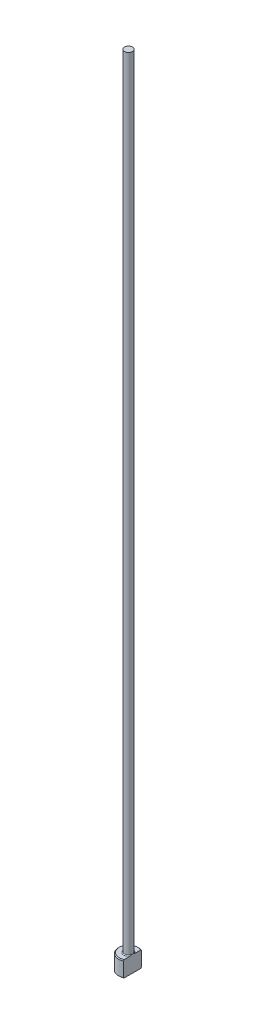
ISO-10303-21;
HEADER;
FILE_DESCRIPTION(('STEP AP214'),'2;1');
FILE_NAME('part.step','',(''),(''),'','','');
FILE_SCHEMA(('AUTOMOTIVE_DESIGN { 1 0 10303 214 1 1 1 1 }'));
ENDSEC;
DATA;
#1=APPLICATION_CONTEXT('core data for automotive mechanical design processes');
#2=APPLICATION_PROTOCOL_DEFINITION('international standard','automotive_design',2000,#1);
#3=PRODUCT_CONTEXT('',#1,'mechanical');
#4=PRODUCT('Part','Part','',(#3));
#5=PRODUCT_RELATED_PRODUCT_CATEGORY('part','',(#4));
#6=PRODUCT_DEFINITION_FORMATION('','',#4);
#7=PRODUCT_DEFINITION_CONTEXT('part definition',#1,'design');
#8=PRODUCT_DEFINITION('design','',#6,#7);
#9=PRODUCT_DEFINITION_SHAPE('','',#8);
#10=(LENGTH_UNIT() NAMED_UNIT(*) SI_UNIT(.MILLI.,.METRE.));
#11=(NAMED_UNIT(*) PLANE_ANGLE_UNIT() SI_UNIT($,.RADIAN.));
#12=(NAMED_UNIT(*) SI_UNIT($,.STERADIAN.) SOLID_ANGLE_UNIT());
#13=UNCERTAINTY_MEASURE_WITH_UNIT(LENGTH_MEASURE(1.E-05),#10,'distance_accuracy_value','');
#14=(GEOMETRIC_REPRESENTATION_CONTEXT(3) GLOBAL_UNCERTAINTY_ASSIGNED_CONTEXT((#13)) GLOBAL_UNIT_ASSIGNED_CONTEXT((#10,
#11,#12)) REPRESENTATION_CONTEXT('',''));
#15=CARTESIAN_POINT('',(0.,0.,0.));
#16=DIRECTION('',(0.,0.,1.));
#17=DIRECTION('',(1.,0.,0.));
#18=AXIS2_PLACEMENT_3D('',#15,#16,#17);
#19=CARTESIAN_POINT('',(0.,0.,0.));
#20=DIRECTION('',(0.,-1.,0.));
#21=DIRECTION('',(0.,0.,-1.));
#22=AXIS2_PLACEMENT_3D('',#19,#20,#21);
#23=PLANE('',#22);
#24=CARTESIAN_POINT('',(0.,0.,0.));
#25=DIRECTION('',(0.,-1.,0.));
#26=DIRECTION('',(0.,0.,-1.));
#27=AXIS2_PLACEMENT_3D('',#24,#25,#26);
#28=CIRCLE('',#27,2.29999999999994);
#29=CARTESIAN_POINT('',(0.999999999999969,0.,2.07123151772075));
#30=VERTEX_POINT('',#29);
#31=CARTESIAN_POINT('',(0.999999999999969,0.,-2.07123151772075));
#32=VERTEX_POINT('',#31);
#33=EDGE_CURVE('E98',#30,#32,#28,.T.);
#34=ORIENTED_EDGE('',*,*,#33,.T.);
#35=DIRECTION('',(0.,0.,1.));
#36=VECTOR('',#35,1.);
#37=CARTESIAN_POINT('',(0.999999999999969,0.,2.2912878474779));
#38=LINE('',#37,#36);
#39=EDGE_CURVE('E83',#32,#30,#38,.T.);
#40=ORIENTED_EDGE('',*,*,#39,.T.);
#41=EDGE_LOOP('',(#34,#40));
#42=FACE_BOUND('',#41,.T.);
#43=ADVANCED_FACE('F32',(#42),#23,.T.);
#44=CARTESIAN_POINT('',(0.,259.958771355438,0.));
#45=DIRECTION('',(0.,1.,0.));
#46=DIRECTION('',(0.,0.,1.));
#47=AXIS2_PLACEMENT_3D('',#44,#45,#46);
#48=CYLINDRICAL_SURFACE('',#47,2.49999999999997);
#49=CARTESIAN_POINT('',(0.,3.80000000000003,0.));
#50=DIRECTION('',(0.,1.,0.));
#51=DIRECTION('',(0.,0.,1.));
#52=AXIS2_PLACEMENT_3D('',#49,#50,#51);
#53=CIRCLE('',#52,2.49999999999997);
#54=CARTESIAN_POINT('',(0.999999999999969,3.80000000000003,2.2912878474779));
#55=VERTEX_POINT('',#54);
#56=CARTESIAN_POINT('',(0.999999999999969,3.80000000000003,-2.2912878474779));
#57=VERTEX_POINT('',#56);
#58=EDGE_CURVE('E104',#55,#57,#53,.F.);
#59=ORIENTED_EDGE('',*,*,#58,.T.);
#60=DIRECTION('',(0.,-1.,0.));
#61=VECTOR('',#60,1.);
#62=CARTESIAN_POINT('',(0.999999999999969,200.,-2.2912878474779));
#63=LINE('',#62,#61);
#64=CARTESIAN_POINT('',(0.999999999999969,0.199999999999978,-2.2912878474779));
#65=VERTEX_POINT('',#64);
#66=EDGE_CURVE('E183',#57,#65,#63,.T.);
#67=ORIENTED_EDGE('',*,*,#66,.T.);
#68=CARTESIAN_POINT('',(0.,0.199999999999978,0.));
#69=DIRECTION('',(0.,-1.,0.));
#70=DIRECTION('',(0.,0.,-1.));
#71=AXIS2_PLACEMENT_3D('',#68,#69,#70);
#72=CIRCLE('',#71,2.49999999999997);
#73=CARTESIAN_POINT('',(0.999999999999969,0.199999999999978,2.2912878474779));
#74=VERTEX_POINT('',#73);
#75=EDGE_CURVE('E100',#65,#74,#72,.F.);
#76=ORIENTED_EDGE('',*,*,#75,.T.);
#77=DIRECTION('',(0.,-1.,0.));
#78=VECTOR('',#77,1.);
#79=CARTESIAN_POINT('',(0.999999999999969,200.,2.2912878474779));
#80=LINE('',#79,#78);
#81=EDGE_CURVE('E93',#55,#74,#80,.T.);
#82=ORIENTED_EDGE('',*,*,#81,.F.);
#83=EDGE_LOOP('',(#59,#67,#76,#82));
#84=FACE_BOUND('',#83,.T.);
#85=ADVANCED_FACE('F158',(#84),#48,.T.);
#86=CARTESIAN_POINT('',(-2.49999999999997,4.,0.));
#87=DIRECTION('',(0.,1.,0.));
#88=DIRECTION('',(0.,0.,1.));
#89=AXIS2_PLACEMENT_3D('',#86,#87,#88);
#90=PLANE('',#89);
#91=CARTESIAN_POINT('',(0.,4.,0.));
#92=DIRECTION('',(0.,1.,0.));
#93=DIRECTION('',(0.,0.,1.));
#94=AXIS2_PLACEMENT_3D('',#91,#92,#93);
#95=CIRCLE('',#94,2.3);
#96=CARTESIAN_POINT('',(0.999999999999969,4.,-2.07123151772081));
#97=VERTEX_POINT('',#96);
#98=CARTESIAN_POINT('',(0.999999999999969,4.,2.07123151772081));
#99=VERTEX_POINT('',#98);
#100=EDGE_CURVE('E178',#97,#99,#95,.T.);
#101=ORIENTED_EDGE('',*,*,#100,.T.);
#102=DIRECTION('',(0.,0.,-1.));
#103=VECTOR('',#102,1.);
#104=CARTESIAN_POINT('',(0.999999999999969,4.,0.));
#105=LINE('',#104,#103);
#106=CARTESIAN_POINT('',(0.999999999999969,3.99999999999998,0.663324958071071));
#107=VERTEX_POINT('',#106);
#108=EDGE_CURVE('E57',#99,#107,#105,.T.);
#109=ORIENTED_EDGE('',*,*,#108,.T.);
#110=CARTESIAN_POINT('',(0.,4.,0.));
#111=DIRECTION('',(0.,1.,0.));
#112=DIRECTION('',(0.,0.,1.));
#113=AXIS2_PLACEMENT_3D('',#110,#111,#112);
#114=CIRCLE('',#113,1.19999999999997);
#115=CARTESIAN_POINT('',(0.999999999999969,3.99999999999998,-0.663324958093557));
#116=VERTEX_POINT('',#115);
#117=EDGE_CURVE('E107',#107,#116,#114,.F.);
#118=ORIENTED_EDGE('',*,*,#117,.T.);
#119=EDGE_CURVE('E136',#116,#97,#105,.T.);
#120=ORIENTED_EDGE('',*,*,#119,.T.);
#121=EDGE_LOOP('',(#101,#109,#118,#120));
#122=FACE_BOUND('',#121,.T.);
#123=ADVANCED_FACE('F147',(#122),#90,.T.);
#124=CARTESIAN_POINT('',(0.,4.,0.));
#125=DIRECTION('',(0.,-1.,0.));
#126=DIRECTION('',(0.,0.,-1.));
#127=AXIS2_PLACEMENT_3D('',#124,#125,#126);
#128=CONICAL_SURFACE('',#127,2.3,0.785398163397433);
#129=ORIENTED_EDGE('',*,*,#58,.F.);
#130=CARTESIAN_POINT('',(0.999999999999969,1.15817039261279,5.043650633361));
#131=CARTESIAN_POINT('',(0.999999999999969,1.28171614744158,4.91769392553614));
#132=CARTESIAN_POINT('',(0.999999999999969,1.40517853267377,4.7916552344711));
#133=CARTESIAN_POINT('',(0.999999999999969,1.65205736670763,4.53917252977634));
#134=CARTESIAN_POINT('',(0.999999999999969,1.7754734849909,4.41272819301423));
#135=CARTESIAN_POINT('',(0.999999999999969,2.02507999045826,4.15641759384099));
#136=CARTESIAN_POINT('',(0.999999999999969,2.15126317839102,4.02654431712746));
#137=CARTESIAN_POINT('',(0.999999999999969,2.40304621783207,3.76660249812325));
#138=CARTESIAN_POINT('',(0.999999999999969,2.52864665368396,3.63653452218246));
#139=CARTESIAN_POINT('',(0.999999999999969,2.7677697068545,3.38787610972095));
#140=CARTESIAN_POINT('',(0.999999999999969,2.88133977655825,3.26933134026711));
#141=CARTESIAN_POINT('',(0.999999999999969,3.10787167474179,3.03166264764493));
#142=CARTESIAN_POINT('',(0.999999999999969,3.22083350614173,2.91253872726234));
#143=CARTESIAN_POINT('',(0.999999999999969,3.4465699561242,2.67277252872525));
#144=CARTESIAN_POINT('',(0.999999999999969,3.55933947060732,2.5521254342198));
#145=CARTESIAN_POINT('',(0.999999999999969,3.7835162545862,2.30972256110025));
#146=CARTESIAN_POINT('',(0.999999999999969,3.8949243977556,2.18796759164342));
#147=CARTESIAN_POINT('',(0.999999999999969,4.11318730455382,1.94548589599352));
#148=CARTESIAN_POINT('',(0.999999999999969,4.22008776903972,1.82480064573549));
#149=CARTESIAN_POINT('',(0.999999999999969,4.37813361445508,1.64149718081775));
#150=CARTESIAN_POINT('',(0.999999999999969,4.43049954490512,1.57993333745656));
#151=CARTESIAN_POINT('',(0.999999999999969,4.53410631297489,1.45586813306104));
#152=CARTESIAN_POINT('',(0.999999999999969,4.58534721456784,1.39336682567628));
#153=CARTESIAN_POINT('',(0.999999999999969,4.68568582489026,1.26783988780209));
#154=CARTESIAN_POINT('',(0.999999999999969,4.734801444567,1.20482863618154));
#155=CARTESIAN_POINT('',(0.999999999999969,4.83086890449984,1.07709082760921));
#156=CARTESIAN_POINT('',(0.999999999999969,4.87781921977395,1.01236311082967));
#157=CARTESIAN_POINT('',(0.999999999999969,4.968185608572,0.88091166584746));
#158=CARTESIAN_POINT('',(0.999999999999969,5.01161706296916,0.814198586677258));
#159=CARTESIAN_POINT('',(0.999999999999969,5.09325231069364,0.677671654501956));
#160=CARTESIAN_POINT('',(0.999999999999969,5.13146487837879,0.60786327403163));
#161=CARTESIAN_POINT('',(0.999999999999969,5.1726089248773,0.520757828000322));
#162=CARTESIAN_POINT('',(0.999999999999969,5.17963219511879,0.505387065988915));
#163=CARTESIAN_POINT('',(0.999999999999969,5.19324475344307,0.47444817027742));
#164=CARTESIAN_POINT('',(0.999999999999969,5.19983388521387,0.458879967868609));
#165=CARTESIAN_POINT('',(0.999999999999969,5.21887613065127,0.411884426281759));
#166=CARTESIAN_POINT('',(0.999999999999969,5.2306077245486,0.380158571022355));
#167=CARTESIAN_POINT('',(0.999999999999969,5.25156131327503,0.3164103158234));
#168=CARTESIAN_POINT('',(0.999999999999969,5.26081845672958,0.284399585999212));
#169=CARTESIAN_POINT('',(0.999999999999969,5.27663134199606,0.219696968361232));
#170=CARTESIAN_POINT('',(0.999999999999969,5.28318629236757,0.18700488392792));
#171=CARTESIAN_POINT('',(0.999999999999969,5.2933221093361,0.120434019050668));
#172=CARTESIAN_POINT('',(0.999999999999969,5.29683603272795,0.0865448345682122));
#173=CARTESIAN_POINT('',(0.999999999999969,5.30040235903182,0.0185934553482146));
#174=CARTESIAN_POINT('',(0.999999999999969,5.30045600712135,-0.0154686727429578));
#175=CARTESIAN_POINT('',(0.999999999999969,5.29709918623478,-0.0834515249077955));
#176=CARTESIAN_POINT('',(0.999999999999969,5.29368537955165,-0.117372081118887));
#177=CARTESIAN_POINT('',(0.999999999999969,5.28362616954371,-0.184734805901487));
#178=CARTESIAN_POINT('',(0.999999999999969,5.27697933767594,-0.218176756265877));
#179=CARTESIAN_POINT('',(0.999999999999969,5.25861838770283,-0.293522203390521));
#180=CARTESIAN_POINT('',(0.999999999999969,5.24601100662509,-0.335206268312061));
#181=CARTESIAN_POINT('',(0.999999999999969,5.21711806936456,-0.417267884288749));
#182=CARTESIAN_POINT('',(0.999999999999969,5.20083078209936,-0.457644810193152));
#183=CARTESIAN_POINT('',(0.999999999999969,5.16531625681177,-0.537392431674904));
#184=CARTESIAN_POINT('',(0.999999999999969,5.1460699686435,-0.576754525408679));
#185=CARTESIAN_POINT('',(0.999999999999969,5.10541239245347,-0.654316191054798));
#186=CARTESIAN_POINT('',(0.999999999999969,5.08400173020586,-0.692516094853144));
#187=CARTESIAN_POINT('',(0.999999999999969,5.0381127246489,-0.770330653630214));
#188=CARTESIAN_POINT('',(0.999999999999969,5.01352589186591,-0.809880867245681));
#189=CARTESIAN_POINT('',(0.999999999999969,4.96292539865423,-0.88806136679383));
#190=CARTESIAN_POINT('',(0.999999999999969,4.93691146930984,-0.926691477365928));
#191=CARTESIAN_POINT('',(0.999999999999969,4.85720012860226,-1.04150369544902));
#192=CARTESIAN_POINT('',(0.999999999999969,4.80186935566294,-1.11654866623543));
#193=CARTESIAN_POINT('',(0.999999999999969,4.68838315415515,-1.26473866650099));
#194=CARTESIAN_POINT('',(0.999999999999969,4.63022092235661,-1.33787839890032));
#195=CARTESIAN_POINT('',(0.999999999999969,4.51208910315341,-1.48269245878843));
#196=CARTESIAN_POINT('',(0.999999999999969,4.45211930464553,-1.55436661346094));
#197=CARTESIAN_POINT('',(0.999999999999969,4.33067987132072,-1.69694421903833));
#198=CARTESIAN_POINT('',(0.999999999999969,4.26920502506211,-1.76784320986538));
#199=CARTESIAN_POINT('',(0.999999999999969,4.14533845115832,-1.90884637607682));
#200=CARTESIAN_POINT('',(0.999999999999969,4.08294663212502,-1.97895047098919));
#201=CARTESIAN_POINT('',(0.999999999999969,3.89498664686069,-2.18811918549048));
#202=CARTESIAN_POINT('',(0.999999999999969,3.76842113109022,-2.32628638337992));
#203=CARTESIAN_POINT('',(0.999999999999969,3.5387546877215,-2.57413295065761));
#204=CARTESIAN_POINT('',(0.999999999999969,3.43593273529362,-2.68407249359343));
#205=CARTESIAN_POINT('',(0.999999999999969,3.22955977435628,-2.9032684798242));
#206=CARTESIAN_POINT('',(0.999999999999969,3.12600875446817,-3.01252491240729));
#207=CARTESIAN_POINT('',(0.999999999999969,2.81444279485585,-3.33969806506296));
#208=CARTESIAN_POINT('',(0.999999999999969,2.60565048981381,-3.55687358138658));
#209=CARTESIAN_POINT('',(0.999999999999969,2.19072410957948,-3.98610808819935));
#210=CARTESIAN_POINT('',(0.999999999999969,1.98461149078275,-4.19818787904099));
#211=CARTESIAN_POINT('',(0.999999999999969,1.674966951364,-4.51569174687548));
#212=CARTESIAN_POINT('',(0.999999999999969,1.57171087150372,-4.62138500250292));
#213=CARTESIAN_POINT('',(0.999999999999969,1.36504682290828,-4.83262218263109));
#214=CARTESIAN_POINT('',(0.999999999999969,1.26163885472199,-4.93816610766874));
#215=CARTESIAN_POINT('',(0.999999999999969,1.15817039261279,-5.043650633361));
#216=B_SPLINE_CURVE_WITH_KNOTS('',3,(#130,#131,#132,#133,#134,#135,#136,#137,#138,#139,#140,
#141,#142,#143,#144,#145,#146,#147,#148,#149,#150,#151,#152,#153,#154,#155,#156,#157,#158,#159,
#160,#161,#162,#163,#164,#165,#166,#167,#168,#169,#170,#171,#172,#173,#174,#175,#176,#177,#178,
#179,#180,#181,#182,#183,#184,#185,#186,#187,#188,#189,#190,#191,#192,#193,#194,#195,#196,#197,
#198,#199,#200,#201,#202,#203,#204,#205,#206,#207,#208,#209,#210,#211,#212,#213,#214,#215),
.UNSPECIFIED.,.F.,.F.,(4,2,2,2,2,2,2,2,2,2,2,2,2,2,2,2,2,2,2,2,2,2,2,2,2,2,2,2,2,2,2,2,2,2,2,2,
2,2,2,2,2,2,4),(0.,0.529299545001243,1.0593722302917,1.6026057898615,2.14504205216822,
2.6375434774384,3.13004253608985,3.62546908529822,4.12055895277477,4.60418442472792,
4.84664313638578,5.08908802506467,5.32873451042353,5.56854727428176,5.80724786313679,
6.0455420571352,6.09623410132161,6.14694429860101,6.24833951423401,6.3482070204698,
6.44810375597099,6.55014736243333,6.65215424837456,6.75425941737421,6.85640974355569,
6.98682841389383,7.11730856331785,7.2486669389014,7.37998744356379,7.51965621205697,
7.65935139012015,7.93894909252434,8.21925538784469,8.49959454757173,8.78110270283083,
9.06263910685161,9.62473592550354,10.0763211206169,10.5279133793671,11.4316934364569,
12.3189018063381,12.7621802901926,13.2054571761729),.UNSPECIFIED.);
#217=EDGE_CURVE('E135',#55,#99,#216,.T.);
#218=ORIENTED_EDGE('',*,*,#217,.T.);
#219=ORIENTED_EDGE('',*,*,#100,.F.);
#220=EDGE_CURVE('E127',#97,#57,#216,.T.);
#221=ORIENTED_EDGE('',*,*,#220,.T.);
#222=EDGE_LOOP('',(#129,#218,#219,#221));
#223=FACE_BOUND('',#222,.T.);
#224=ADVANCED_FACE('F143',(#223),#128,.T.);
#225=CARTESIAN_POINT('',(0.,0.199999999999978,0.));
#226=DIRECTION('',(0.,1.,0.));
#227=DIRECTION('',(0.,0.,1.));
#228=AXIS2_PLACEMENT_3D('',#225,#226,#227);
#229=CONICAL_SURFACE('',#228,2.49999999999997,0.785398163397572);
#230=ORIENTED_EDGE('',*,*,#75,.F.);
#231=CARTESIAN_POINT('',(0.999999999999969,2.84182960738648,-5.043650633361));
#232=CARTESIAN_POINT('',(0.999999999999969,2.71828385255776,-4.91769392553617));
#233=CARTESIAN_POINT('',(0.999999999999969,2.59482146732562,-4.79165523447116));
#234=CARTESIAN_POINT('',(0.999999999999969,2.34794263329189,-4.53917252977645));
#235=CARTESIAN_POINT('',(0.999999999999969,2.22452651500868,-4.41272819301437));
#236=CARTESIAN_POINT('',(0.999999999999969,1.97492000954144,-4.15641759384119));
#237=CARTESIAN_POINT('',(0.999999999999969,1.84873682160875,-4.02654431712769));
#238=CARTESIAN_POINT('',(0.999999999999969,1.59695378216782,-3.76660249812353));
#239=CARTESIAN_POINT('',(0.999999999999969,1.47135334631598,-3.63653452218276));
#240=CARTESIAN_POINT('',(0.999999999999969,1.23223029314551,-3.38787610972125));
#241=CARTESIAN_POINT('',(0.999999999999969,1.11866022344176,-3.26933134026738));
#242=CARTESIAN_POINT('',(0.999999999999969,0.892128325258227,-3.03166264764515));
#243=CARTESIAN_POINT('',(0.999999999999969,0.779166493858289,-2.91253872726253));
#244=CARTESIAN_POINT('',(0.999999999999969,0.553430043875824,-2.67277252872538));
#245=CARTESIAN_POINT('',(0.999999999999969,0.440660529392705,-2.55212543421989));
#246=CARTESIAN_POINT('',(0.999999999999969,0.216483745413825,-2.30972256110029));
#247=CARTESIAN_POINT('',(0.999999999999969,0.105075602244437,-2.18796759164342));
#248=CARTESIAN_POINT('',(0.999999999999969,-0.113187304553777,-1.94548589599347));
#249=CARTESIAN_POINT('',(0.999999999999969,-0.220087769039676,-1.8248006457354));
#250=CARTESIAN_POINT('',(0.999999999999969,-0.378133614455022,-1.64149718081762));
#251=CARTESIAN_POINT('',(0.999999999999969,-0.430499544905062,-1.57993333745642));
#252=CARTESIAN_POINT('',(0.999999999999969,-0.534106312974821,-1.45586813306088));
#253=CARTESIAN_POINT('',(0.999999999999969,-0.585347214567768,-1.3933668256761));
#254=CARTESIAN_POINT('',(0.999999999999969,-0.685685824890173,-1.26783988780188));
#255=CARTESIAN_POINT('',(0.999999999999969,-0.734801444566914,-1.20482863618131));
#256=CARTESIAN_POINT('',(0.999999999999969,-0.830868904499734,-1.07709082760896));
#257=CARTESIAN_POINT('',(0.999999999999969,-0.877819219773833,-1.0123631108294));
#258=CARTESIAN_POINT('',(0.999999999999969,-0.96818560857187,-0.880911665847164));
#259=CARTESIAN_POINT('',(0.999999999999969,-1.01161706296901,-0.814198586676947));
#260=CARTESIAN_POINT('',(0.999999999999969,-1.09325231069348,-0.677671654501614));
#261=CARTESIAN_POINT('',(0.999999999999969,-1.1314648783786,-0.607863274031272));
#262=CARTESIAN_POINT('',(0.999999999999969,-1.17260892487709,-0.520757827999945));
#263=CARTESIAN_POINT('',(0.999999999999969,-1.17963219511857,-0.505387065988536));
#264=CARTESIAN_POINT('',(0.999999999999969,-1.19324475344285,-0.474448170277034));
#265=CARTESIAN_POINT('',(0.999999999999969,-1.19983388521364,-0.45887996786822));
#266=CARTESIAN_POINT('',(0.999999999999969,-1.21887613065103,-0.411884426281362));
#267=CARTESIAN_POINT('',(0.999999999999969,-1.23060772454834,-0.380158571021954));
#268=CARTESIAN_POINT('',(0.999999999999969,-1.25156131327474,-0.31641031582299));
#269=CARTESIAN_POINT('',(0.999999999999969,-1.26081845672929,-0.284399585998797));
#270=CARTESIAN_POINT('',(0.999999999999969,-1.27663134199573,-0.21969696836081));
#271=CARTESIAN_POINT('',(0.999999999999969,-1.28318629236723,-0.187004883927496));
#272=CARTESIAN_POINT('',(0.999999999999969,-1.29332210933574,-0.12043401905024));
#273=CARTESIAN_POINT('',(0.999999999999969,-1.29683603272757,-0.0865448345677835));
#274=CARTESIAN_POINT('',(0.999999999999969,-1.30040235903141,-0.0185934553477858));
#275=CARTESIAN_POINT('',(0.999999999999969,-1.30045600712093,0.0154686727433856));
#276=CARTESIAN_POINT('',(0.999999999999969,-1.29709918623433,0.0834515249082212));
#277=CARTESIAN_POINT('',(0.999999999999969,-1.29368537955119,0.117372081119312));
#278=CARTESIAN_POINT('',(0.999999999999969,-1.28362616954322,0.184734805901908));
#279=CARTESIAN_POINT('',(0.999999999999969,-1.27697933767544,0.218176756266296));
#280=CARTESIAN_POINT('',(0.999999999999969,-1.2586183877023,0.293522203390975));
#281=CARTESIAN_POINT('',(0.999999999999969,-1.24601100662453,0.335206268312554));
#282=CARTESIAN_POINT('',(0.999999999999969,-1.21711806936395,0.417267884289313));
#283=CARTESIAN_POINT('',(0.999999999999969,-1.20083078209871,0.457644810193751));
#284=CARTESIAN_POINT('',(0.999999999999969,-1.16531625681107,0.537392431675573));
#285=CARTESIAN_POINT('',(0.999999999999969,-1.14606996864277,0.576754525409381));
#286=CARTESIAN_POINT('',(0.999999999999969,-1.10541239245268,0.654316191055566));
#287=CARTESIAN_POINT('',(0.999999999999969,-1.08400173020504,0.692516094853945));
#288=CARTESIAN_POINT('',(0.999999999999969,-1.03811272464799,0.770330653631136));
#289=CARTESIAN_POINT('',(0.999999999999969,-1.01352589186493,0.80988086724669));
#290=CARTESIAN_POINT('',(0.999999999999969,-0.962925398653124,0.888061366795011));
#291=CARTESIAN_POINT('',(0.999999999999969,-0.936911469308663,0.926691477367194));
#292=CARTESIAN_POINT('',(0.999999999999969,-0.857200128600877,1.04150369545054));
#293=CARTESIAN_POINT('',(0.999999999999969,-0.801869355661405,1.11654866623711));
#294=CARTESIAN_POINT('',(0.999999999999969,-0.688383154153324,1.26473866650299));
#295=CARTESIAN_POINT('',(0.999999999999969,-0.630220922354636,1.33787839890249));
#296=CARTESIAN_POINT('',(0.999999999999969,-0.512089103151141,1.48269245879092));
#297=CARTESIAN_POINT('',(0.999999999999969,-0.452119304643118,1.55436661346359));
#298=CARTESIAN_POINT('',(0.999999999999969,-0.330679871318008,1.6969442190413));
#299=CARTESIAN_POINT('',(0.999999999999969,-0.269205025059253,1.76784320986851));
#300=CARTESIAN_POINT('',(0.999999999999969,-0.145338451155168,1.90884637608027));
#301=CARTESIAN_POINT('',(0.999999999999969,-0.0829466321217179,1.9789504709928));
#302=CARTESIAN_POINT('',(0.999999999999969,0.105013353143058,2.18811918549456));
#303=CARTESIAN_POINT('',(0.999999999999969,0.231578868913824,2.32628638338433));
#304=CARTESIAN_POINT('',(0.999999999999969,0.461245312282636,2.57413295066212));
#305=CARTESIAN_POINT('',(0.999999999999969,0.564067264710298,2.68407249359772));
#306=CARTESIAN_POINT('',(0.999999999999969,0.770440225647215,2.90326847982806));
#307=CARTESIAN_POINT('',(0.999999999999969,0.873991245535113,3.01252491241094));
#308=CARTESIAN_POINT('',(0.999999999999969,1.18555720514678,3.33969806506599));
#309=CARTESIAN_POINT('',(0.999999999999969,1.39434951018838,3.5568735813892));
#310=CARTESIAN_POINT('',(0.999999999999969,1.80927589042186,3.98610808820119));
#311=CARTESIAN_POINT('',(0.999999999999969,2.01538850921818,4.19818787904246));
#312=CARTESIAN_POINT('',(0.999999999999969,2.32503304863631,4.5156917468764));
#313=CARTESIAN_POINT('',(0.999999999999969,2.42828912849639,4.62138500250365));
#314=CARTESIAN_POINT('',(0.999999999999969,2.6349531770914,4.83262218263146));
#315=CARTESIAN_POINT('',(0.999999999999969,2.73836114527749,4.93816610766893));
#316=CARTESIAN_POINT('',(0.999999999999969,2.84182960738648,5.043650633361));
#317=B_SPLINE_CURVE_WITH_KNOTS('',3,(#231,#232,#233,#234,#235,#236,#237,#238,#239,#240,#241,
#242,#243,#244,#245,#246,#247,#248,#249,#250,#251,#252,#253,#254,#255,#256,#257,#258,#259,#260,
#261,#262,#263,#264,#265,#266,#267,#268,#269,#270,#271,#272,#273,#274,#275,#276,#277,#278,#279,
#280,#281,#282,#283,#284,#285,#286,#287,#288,#289,#290,#291,#292,#293,#294,#295,#296,#297,#298,
#299,#300,#301,#302,#303,#304,#305,#306,#307,#308,#309,#310,#311,#312,#313,#314,#315,#316),
.UNSPECIFIED.,.F.,.F.,(4,2,2,2,2,2,2,2,2,2,2,2,2,2,2,2,2,2,2,2,2,2,2,2,2,2,2,2,2,2,2,2,2,2,2,2,
2,2,2,2,2,2,4),(0.,0.529299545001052,1.05937223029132,1.60260578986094,2.14504205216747,
2.63754347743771,3.13004253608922,3.62546908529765,4.12055895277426,4.60418442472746,
4.84664313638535,5.08908802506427,5.32873451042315,5.5685472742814,5.80724786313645,
6.04554205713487,6.09623410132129,6.14694429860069,6.24833951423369,6.34820702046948,
6.44810375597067,6.55014736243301,6.65215424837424,6.75425941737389,6.85640974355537,
6.98682841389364,7.11730856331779,7.24866693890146,7.37998744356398,7.51965621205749,
7.659351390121,7.93894909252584,8.21925538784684,8.49959454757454,8.78110270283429,
9.06263910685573,9.62473592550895,10.0763211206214,10.5279133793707,11.4316934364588,
12.3189018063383,12.7621802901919,13.2054571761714),.UNSPECIFIED.);
#318=EDGE_CURVE('E86',#65,#32,#317,.T.);
#319=ORIENTED_EDGE('',*,*,#318,.T.);
#320=ORIENTED_EDGE('',*,*,#33,.F.);
#321=EDGE_CURVE('E89',#30,#74,#317,.T.);
#322=ORIENTED_EDGE('',*,*,#321,.T.);
#323=EDGE_LOOP('',(#230,#319,#320,#322));
#324=FACE_BOUND('',#323,.T.);
#325=ADVANCED_FACE('F97',(#324),#229,.T.);
#326=CARTESIAN_POINT('',(0.,4.19999999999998,0.));
#327=DIRECTION('',(0.,1.,0.));
#328=DIRECTION('',(0.,0.,1.));
#329=AXIS2_PLACEMENT_3D('',#326,#327,#328);
#330=TOROIDAL_SURFACE('',#329,1.19999999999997,0.2);
#331=CARTESIAN_POINT('',(0.999999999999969,4.19999999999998,0.));
#332=CARTESIAN_POINT('',(0.999999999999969,4.20000051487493,2.59065974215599E-12));
#333=CARTESIAN_POINT('',(0.999999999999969,4.20000102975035,-9.42496361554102E-08));
#334=CARTESIAN_POINT('',(0.999999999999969,4.20000202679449,-4.00799852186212E-07));
#335=CARTESIAN_POINT('',(0.999999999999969,4.20000250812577,-6.15372282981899E-07));
#336=CARTESIAN_POINT('',(0.999999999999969,4.20000346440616,-1.13351403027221E-06));
#337=CARTESIAN_POINT('',(0.999999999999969,4.20000393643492,-1.44235226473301E-06));
#338=CARTESIAN_POINT('',(0.999999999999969,4.20000483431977,-2.11388878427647E-06));
#339=CARTESIAN_POINT('',(0.999999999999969,4.20000526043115,-2.47625954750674E-06));
#340=CARTESIAN_POINT('',(0.999999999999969,4.20000666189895,-3.75794161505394E-06));
#341=CARTESIAN_POINT('',(0.999999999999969,4.2000075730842,-4.74818961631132E-06));
#342=CARTESIAN_POINT('',(0.999999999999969,4.20000922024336,-6.81289838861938E-06));
#343=CARTESIAN_POINT('',(0.999999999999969,4.20000996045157,-7.8841765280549E-06));
#344=CARTESIAN_POINT('',(0.999999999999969,4.20001267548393,-1.19907295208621E-05));
#345=CARTESIAN_POINT('',(0.999999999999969,4.20001450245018,-1.51274185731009E-05));
#346=CARTESIAN_POINT('',(0.999999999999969,4.20001755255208,-2.13715427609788E-05));
#347=CARTESIAN_POINT('',(0.999999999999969,4.20001881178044,-2.44620178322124E-05));
#348=CARTESIAN_POINT('',(0.999999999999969,4.20002404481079,-3.74145212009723E-05));
#349=CARTESIAN_POINT('',(0.999999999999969,4.20002793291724,-4.73052128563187E-05));
#350=CARTESIAN_POINT('',(0.999999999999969,4.2000342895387,-6.59457080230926E-05));
#351=CARTESIAN_POINT('',(0.999999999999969,4.20003688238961,-7.46515304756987E-05));
#352=CARTESIAN_POINT('',(0.999999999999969,4.20005709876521,-0.000137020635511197));
#353=CARTESIAN_POINT('',(0.999999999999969,4.20008244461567,-0.000187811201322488));
#354=CARTESIAN_POINT('',(0.999999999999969,4.20017671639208,-0.000384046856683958));
#355=CARTESIAN_POINT('',(0.999999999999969,4.2002399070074,-0.000531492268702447));
#356=CARTESIAN_POINT('',(0.999999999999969,4.20048701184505,-0.00109942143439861));
#357=CARTESIAN_POINT('',(0.999999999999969,4.20067693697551,-0.00151784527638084));
#358=CARTESIAN_POINT('',(0.999999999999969,4.20144296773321,-0.00321386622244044));
#359=CARTESIAN_POINT('',(0.999999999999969,4.20201230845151,-0.00449374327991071));
#360=CARTESIAN_POINT('',(0.999999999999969,4.20998444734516,-0.0224047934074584));
#361=CARTESIAN_POINT('',(0.999999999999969,4.2174352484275,-0.039020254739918));
#362=CARTESIAN_POINT('',(0.999999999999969,4.23197002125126,-0.0717084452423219));
#363=CARTESIAN_POINT('',(0.999999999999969,4.23905766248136,-0.0877796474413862));
#364=CARTESIAN_POINT('',(0.999999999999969,4.25389009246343,-0.121781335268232));
#365=CARTESIAN_POINT('',(0.999999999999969,4.26161964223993,-0.139718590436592));
#366=CARTESIAN_POINT('',(0.999999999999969,4.27689168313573,-0.175878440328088));
#367=CARTESIAN_POINT('',(0.999999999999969,4.28443162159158,-0.19410211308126));
#368=CARTESIAN_POINT('',(0.999999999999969,4.30282726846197,-0.239840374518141));
#369=CARTESIAN_POINT('',(0.999999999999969,4.31345710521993,-0.267447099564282));
#370=CARTESIAN_POINT('',(0.999999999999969,4.33331094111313,-0.322481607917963));
#371=CARTESIAN_POINT('',(0.999999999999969,4.34256072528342,-0.349899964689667));
#372=CARTESIAN_POINT('',(0.999999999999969,4.35732089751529,-0.398044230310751));
#373=CARTESIAN_POINT('',(0.999999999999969,4.36317895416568,-0.418661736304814));
#374=CARTESIAN_POINT('',(0.999999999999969,4.37387907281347,-0.460275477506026));
#375=CARTESIAN_POINT('',(0.999999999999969,4.37871519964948,-0.48127319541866));
#376=CARTESIAN_POINT('',(0.999999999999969,4.39174175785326,-0.546853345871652));
#377=CARTESIAN_POINT('',(0.999999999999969,4.39776253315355,-0.591947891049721));
#378=CARTESIAN_POINT('',(0.999999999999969,4.400401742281,-0.660990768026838));
#379=CARTESIAN_POINT('',(0.999999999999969,4.400126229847,-0.684818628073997));
#380=CARTESIAN_POINT('',(0.999999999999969,4.39660783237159,-0.732027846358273));
#381=CARTESIAN_POINT('',(0.999999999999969,4.39339826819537,-0.755411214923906));
#382=CARTESIAN_POINT('',(0.999999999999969,4.38447874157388,-0.796083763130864));
#383=CARTESIAN_POINT('',(0.999999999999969,4.37951676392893,-0.813533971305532));
#384=CARTESIAN_POINT('',(0.999999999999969,4.36698902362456,-0.847531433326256));
#385=CARTESIAN_POINT('',(0.999999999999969,4.35942232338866,-0.864078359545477));
#386=CARTESIAN_POINT('',(0.999999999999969,4.34431787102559,-0.890141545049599));
#387=CARTESIAN_POINT('',(0.999999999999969,4.33762931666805,-0.900148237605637));
#388=CARTESIAN_POINT('',(0.999999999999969,4.32281345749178,-0.919033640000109));
#389=CARTESIAN_POINT('',(0.999999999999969,4.3146887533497,-0.92791433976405));
#390=CARTESIAN_POINT('',(0.999999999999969,4.29878569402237,-0.942427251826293));
#391=CARTESIAN_POINT('',(0.999999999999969,4.29127620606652,-0.948352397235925));
#392=CARTESIAN_POINT('',(0.999999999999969,4.27538509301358,-0.958904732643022));
#393=CARTESIAN_POINT('',(0.999999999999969,4.26700378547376,-0.963532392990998));
#394=CARTESIAN_POINT('',(0.999999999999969,4.24944905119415,-0.971220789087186));
#395=CARTESIAN_POINT('',(0.999999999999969,4.24026913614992,-0.974266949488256));
#396=CARTESIAN_POINT('',(0.999999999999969,4.22148612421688,-0.978466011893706));
#397=CARTESIAN_POINT('',(0.999999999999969,4.21188346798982,-0.979620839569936));
#398=CARTESIAN_POINT('',(0.999999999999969,4.19406751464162,-0.979911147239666));
#399=CARTESIAN_POINT('',(0.999999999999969,4.18585759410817,-0.979318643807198));
#400=CARTESIAN_POINT('',(0.999999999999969,4.16966497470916,-0.976727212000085));
#401=CARTESIAN_POINT('',(0.999999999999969,4.16168225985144,-0.97472838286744));
#402=CARTESIAN_POINT('',(0.999999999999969,4.14632905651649,-0.969513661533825));
#403=CARTESIAN_POINT('',(0.999999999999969,4.13894889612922,-0.966325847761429));
#404=CARTESIAN_POINT('',(0.999999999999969,4.12474145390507,-0.958901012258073));
#405=CARTESIAN_POINT('',(0.999999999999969,4.11791436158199,-0.954663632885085));
#406=CARTESIAN_POINT('',(0.999999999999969,4.10210888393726,-0.943323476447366));
#407=CARTESIAN_POINT('',(0.999999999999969,4.09345388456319,-0.935769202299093));
#408=CARTESIAN_POINT('',(0.999999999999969,4.07747441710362,-0.9193596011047));
#409=CARTESIAN_POINT('',(0.999999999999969,4.07015330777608,-0.910501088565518));
#410=CARTESIAN_POINT('',(0.999999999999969,4.05394486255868,-0.887884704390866));
#411=CARTESIAN_POINT('',(0.999999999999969,4.04572469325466,-0.873650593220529));
#412=CARTESIAN_POINT('',(0.999999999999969,4.03162462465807,-0.844119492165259));
#413=CARTESIAN_POINT('',(0.999999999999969,4.02574383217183,-0.828822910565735));
#414=CARTESIAN_POINT('',(0.999999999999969,4.01314628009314,-0.788605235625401));
#415=CARTESIAN_POINT('',(0.999999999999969,4.00790637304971,-0.763225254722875));
#416=CARTESIAN_POINT('',(0.999999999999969,4.00123778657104,-0.711706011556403));
#417=CARTESIAN_POINT('',(0.999999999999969,3.99986086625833,-0.685561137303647));
#418=CARTESIAN_POINT('',(0.999999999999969,4.00029138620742,-0.610897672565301));
#419=CARTESIAN_POINT('',(0.999999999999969,4.00583944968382,-0.562408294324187));
#420=CARTESIAN_POINT('',(0.999999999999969,4.01894675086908,-0.492015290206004));
#421=CARTESIAN_POINT('',(0.999999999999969,4.02392178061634,-0.469516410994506));
#422=CARTESIAN_POINT('',(0.999999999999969,4.03507986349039,-0.424950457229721));
#423=CARTESIAN_POINT('',(0.999999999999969,4.04125559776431,-0.402881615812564));
#424=CARTESIAN_POINT('',(0.999999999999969,4.05640318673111,-0.353063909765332));
#425=CARTESIAN_POINT('',(0.999999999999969,4.06567810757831,-0.32540920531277));
#426=CARTESIAN_POINT('',(0.999999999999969,4.08561584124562,-0.269900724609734));
#427=CARTESIAN_POINT('',(0.999999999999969,4.09630536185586,-0.242056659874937));
#428=CARTESIAN_POINT('',(0.999999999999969,4.11482832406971,-0.195905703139));
#429=CARTESIAN_POINT('',(0.999999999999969,4.12243033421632,-0.177504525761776));
#430=CARTESIAN_POINT('',(0.999999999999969,4.13783353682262,-0.140994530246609));
#431=CARTESIAN_POINT('',(0.999999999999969,4.14563210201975,-0.122884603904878));
#432=CARTESIAN_POINT('',(0.999999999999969,4.16059970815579,-0.0885577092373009));
#433=CARTESIAN_POINT('',(0.999999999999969,4.16775305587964,-0.0723337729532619));
#434=CARTESIAN_POINT('',(0.999999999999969,4.18242403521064,-0.039335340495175));
#435=CARTESIAN_POINT('',(0.999999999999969,4.18994542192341,-0.0225624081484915));
#436=CARTESIAN_POINT('',(0.999999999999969,4.19798770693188,-0.00449370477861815));
#437=CARTESIAN_POINT('',(0.999999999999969,4.19855706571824,-0.00321379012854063));
#438=CARTESIAN_POINT('',(0.999999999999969,4.19932310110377,-0.00151776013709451));
#439=CARTESIAN_POINT('',(0.999999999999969,4.19951301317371,-0.00109936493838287));
#440=CARTESIAN_POINT('',(0.999999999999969,4.19976010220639,-0.000531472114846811));
#441=CARTESIAN_POINT('',(0.999999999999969,4.19982328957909,-0.000384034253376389));
#442=CARTESIAN_POINT('',(0.999999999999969,4.19991755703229,-0.00018780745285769));
#443=CARTESIAN_POINT('',(0.999999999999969,4.19994290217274,-0.000137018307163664));
#444=CARTESIAN_POINT('',(0.999999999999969,4.19996311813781,-7.46508468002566E-05));
#445=CARTESIAN_POINT('',(0.999999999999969,4.19996571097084,-6.59451384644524E-05));
#446=CARTESIAN_POINT('',(0.999999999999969,4.19997206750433,-4.73048902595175E-05));
#447=CARTESIAN_POINT('',(0.999999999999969,4.19997595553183,-3.74143283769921E-05));
#448=CARTESIAN_POINT('',(0.999999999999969,4.19998118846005,-2.44619708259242E-05));
#449=CARTESIAN_POINT('',(0.999999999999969,4.19998244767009,-2.13715143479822E-05));
#450=CARTESIAN_POINT('',(0.999999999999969,4.19998549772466,-1.51274244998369E-05));
#451=CARTESIAN_POINT('',(0.999999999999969,4.19998732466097,-1.19907505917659E-05));
#452=CARTESIAN_POINT('',(0.999999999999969,4.19999003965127,-7.88421144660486E-06));
#453=CARTESIAN_POINT('',(0.999999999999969,4.19999077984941,-6.81293476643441E-06));
#454=CARTESIAN_POINT('',(0.999999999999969,4.19999242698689,-4.74822687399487E-06));
#455=CARTESIAN_POINT('',(0.999999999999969,4.19999333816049,-3.75797821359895E-06));
#456=CARTESIAN_POINT('',(0.999999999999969,4.19999473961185,-2.47629279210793E-06));
#457=CARTESIAN_POINT('',(0.999999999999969,4.19999516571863,-2.11392057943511E-06));
#458=CARTESIAN_POINT('',(0.999999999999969,4.19999606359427,-1.44238034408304E-06));
#459=CARTESIAN_POINT('',(0.999999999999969,4.19999653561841,-1.13353983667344E-06));
#460=CARTESIAN_POINT('',(0.999999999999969,4.1999974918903,-6.15392582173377E-07));
#461=CARTESIAN_POINT('',(0.999999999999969,4.19999797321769,-4.0081700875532E-07));
#462=CARTESIAN_POINT('',(0.999999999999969,4.19999897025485,-9.42592138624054E-08));
#463=CARTESIAN_POINT('',(0.999999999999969,4.19999948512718,-2.59064895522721E-12));
#464=CARTESIAN_POINT('',(0.999999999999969,4.19999999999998,0.));
#465=B_SPLINE_CURVE_WITH_KNOTS('',3,(#331,#332,#333,#334,#335,#336,#337,#338,#339,#340,#341,
#342,#343,#344,#345,#346,#347,#348,#349,#350,#351,#352,#353,#354,#355,#356,#357,#358,#359,#360,
#361,#362,#363,#364,#365,#366,#367,#368,#369,#370,#371,#372,#373,#374,#375,#376,#377,#378,#379,
#380,#381,#382,#383,#384,#385,#386,#387,#388,#389,#390,#391,#392,#393,#394,#395,#396,#397,#398,
#399,#400,#401,#402,#403,#404,#405,#406,#407,#408,#409,#410,#411,#412,#413,#414,#415,#416,#417,
#418,#419,#420,#421,#422,#423,#424,#425,#426,#427,#428,#429,#430,#431,#432,#433,#434,#435,#436,
#437,#438,#439,#440,#441,#442,#443,#444,#445,#446,#447,#448,#449,#450,#451,#452,#453,#454,#455,
#456,#457,#458,#459,#460,#461,#462,#463,#464),.UNSPECIFIED.,.T.,.F.,(4,2,2,2,2,2,2,2,2,2,2,2,2,
2,2,2,2,2,2,2,2,2,2,2,2,2,2,2,2,2,2,2,2,2,2,2,2,2,2,2,2,2,2,2,2,2,2,2,2,2,2,2,2,2,2,2,2,2,2,2,2,
2,2,2,2,2,4),(0.,1.54318091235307E-06,3.11656704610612E-06,4.80252014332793E-06,
6.4785555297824E-06,1.04956561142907E-05,1.4398891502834E-05,2.52504393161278E-05,
3.52518424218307E-05,6.71249457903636E-05,9.43496749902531E-05,0.000263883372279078,
0.000745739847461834,0.00212351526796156,0.00632669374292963,0.0609485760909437,
0.11364394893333,0.172237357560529,0.23140101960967,0.320129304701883,0.40690543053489,
0.471177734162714,0.535813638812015,0.67161710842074,0.742973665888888,0.813529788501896,
0.867802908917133,0.922095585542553,0.958095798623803,0.994031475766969,1.02261929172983,
1.05119673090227,1.08003306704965,1.1088400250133,1.1334101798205,1.15797860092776,
1.18200020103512,1.20602999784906,1.24030227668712,1.27465969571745,1.32369575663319,
1.37271307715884,1.45002425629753,1.52836647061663,1.67385288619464,1.74297459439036,
1.81168748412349,1.89915940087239,1.98861529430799,2.04834216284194,2.10749314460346,
2.16068730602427,2.21582681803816,2.22003012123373,2.221407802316,2.22188963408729,
2.2220591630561,2.22208638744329,2.22211826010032,2.22212826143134,2.22213911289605,
2.22214301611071,2.22214703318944,2.22214870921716,2.22215039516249,2.22215196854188,
2.22215351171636),.UNSPECIFIED.);
#466=CARTESIAN_POINT('',(0.999999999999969,4.19999999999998,0.));
#467=VERTEX_POINT('',#466);
#468=EDGE_CURVE('E11',#116,#467,#465,.T.);
#469=ORIENTED_EDGE('',*,*,#468,.F.);
#470=ORIENTED_EDGE('',*,*,#117,.F.);
#471=CARTESIAN_POINT('',(0.999999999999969,4.19999999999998,0.));
#472=CARTESIAN_POINT('',(0.999999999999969,4.19999948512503,-2.59066338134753E-12));
#473=CARTESIAN_POINT('',(0.999999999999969,4.19999897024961,9.42496361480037E-08));
#474=CARTESIAN_POINT('',(0.999999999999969,4.19999797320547,4.00799852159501E-07));
#475=CARTESIAN_POINT('',(0.999999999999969,4.19999749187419,6.15372282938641E-07));
#476=CARTESIAN_POINT('',(0.999999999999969,4.1999965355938,1.13351403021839E-06));
#477=CARTESIAN_POINT('',(0.999999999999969,4.19999606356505,1.44235226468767E-06));
#478=CARTESIAN_POINT('',(0.999999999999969,4.19999516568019,2.1138887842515E-06));
#479=CARTESIAN_POINT('',(0.999999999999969,4.19999473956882,2.47625954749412E-06));
#480=CARTESIAN_POINT('',(0.999999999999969,4.19999333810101,3.75794161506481E-06));
#481=CARTESIAN_POINT('',(0.999999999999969,4.19999242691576,4.74818961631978E-06));
#482=CARTESIAN_POINT('',(0.999999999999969,4.1999907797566,6.8128983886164E-06));
#483=CARTESIAN_POINT('',(0.999999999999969,4.19999003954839,7.88417652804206E-06));
#484=CARTESIAN_POINT('',(0.999999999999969,4.19998732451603,1.19907295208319E-05));
#485=CARTESIAN_POINT('',(0.999999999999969,4.19998549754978,1.5127418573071E-05));
#486=CARTESIAN_POINT('',(0.999999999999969,4.19998244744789,2.13715427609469E-05));
#487=CARTESIAN_POINT('',(0.999999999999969,4.19998118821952,2.44620178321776E-05));
#488=CARTESIAN_POINT('',(0.999999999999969,4.19997595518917,3.74145212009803E-05));
#489=CARTESIAN_POINT('',(0.999999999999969,4.19997206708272,4.73052128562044E-05));
#490=CARTESIAN_POINT('',(0.999999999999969,4.19996571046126,6.59457080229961E-05));
#491=CARTESIAN_POINT('',(0.999999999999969,4.19996311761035,7.46515304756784E-05));
#492=CARTESIAN_POINT('',(0.999999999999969,4.19994290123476,0.000137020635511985));
#493=CARTESIAN_POINT('',(0.999999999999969,4.19991755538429,0.000187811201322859));
#494=CARTESIAN_POINT('',(0.999999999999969,4.19982328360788,0.00038404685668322));
#495=CARTESIAN_POINT('',(0.999999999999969,4.19976009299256,0.000531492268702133));
#496=CARTESIAN_POINT('',(0.999999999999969,4.19951298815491,0.0010994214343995));
#497=CARTESIAN_POINT('',(0.999999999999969,4.19932306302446,0.00151784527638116));
#498=CARTESIAN_POINT('',(0.999999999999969,4.19855703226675,0.00321386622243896));
#499=CARTESIAN_POINT('',(0.999999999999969,4.19798769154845,0.00449374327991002));
#500=CARTESIAN_POINT('',(0.999999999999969,4.19001555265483,0.0224047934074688));
#501=CARTESIAN_POINT('',(0.999999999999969,4.18256475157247,0.0390202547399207));
#502=CARTESIAN_POINT('',(0.999999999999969,4.16802997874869,0.0717084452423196));
#503=CARTESIAN_POINT('',(0.999999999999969,4.1609423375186,0.0877796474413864));
#504=CARTESIAN_POINT('',(0.999999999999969,4.14610990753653,0.121781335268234));
#505=CARTESIAN_POINT('',(0.999999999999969,4.13838035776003,0.139718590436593));
#506=CARTESIAN_POINT('',(0.999999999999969,4.12310831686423,0.175878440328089));
#507=CARTESIAN_POINT('',(0.999999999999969,4.11556837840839,0.194102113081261));
#508=CARTESIAN_POINT('',(0.999999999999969,4.09717273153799,0.239840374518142));
#509=CARTESIAN_POINT('',(0.999999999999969,4.08654289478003,0.267447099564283));
#510=CARTESIAN_POINT('',(0.999999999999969,4.06668905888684,0.322481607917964));
#511=CARTESIAN_POINT('',(0.999999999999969,4.05743927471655,0.349899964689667));
#512=CARTESIAN_POINT('',(0.999999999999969,4.04267910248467,0.398044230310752));
#513=CARTESIAN_POINT('',(0.999999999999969,4.03682104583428,0.418661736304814));
#514=CARTESIAN_POINT('',(0.999999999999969,4.02612092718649,0.460275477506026));
#515=CARTESIAN_POINT('',(0.999999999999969,4.02128480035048,0.48127319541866));
#516=CARTESIAN_POINT('',(0.999999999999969,4.0082582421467,0.546853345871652));
#517=CARTESIAN_POINT('',(0.999999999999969,4.00223746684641,0.591947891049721));
#518=CARTESIAN_POINT('',(0.999999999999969,3.99959825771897,0.660990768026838));
#519=CARTESIAN_POINT('',(0.999999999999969,3.99987377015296,0.684818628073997));
#520=CARTESIAN_POINT('',(0.999999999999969,4.00339216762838,0.732027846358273));
#521=CARTESIAN_POINT('',(0.999999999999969,4.00660173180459,0.755411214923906));
#522=CARTESIAN_POINT('',(0.999999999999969,4.01552125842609,0.796083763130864));
#523=CARTESIAN_POINT('',(0.999999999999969,4.02048323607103,0.813533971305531));
#524=CARTESIAN_POINT('',(0.999999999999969,4.0330109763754,0.847531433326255));
#525=CARTESIAN_POINT('',(0.999999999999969,4.0405776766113,0.864078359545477));
#526=CARTESIAN_POINT('',(0.999999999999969,4.05568212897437,0.890141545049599));
#527=CARTESIAN_POINT('',(0.999999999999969,4.06237068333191,0.900148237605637));
#528=CARTESIAN_POINT('',(0.999999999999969,4.07718654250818,0.919033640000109));
#529=CARTESIAN_POINT('',(0.999999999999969,4.08531124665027,0.92791433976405));
#530=CARTESIAN_POINT('',(0.999999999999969,4.10121430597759,0.942427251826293));
#531=CARTESIAN_POINT('',(0.999999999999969,4.10872379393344,0.948352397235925));
#532=CARTESIAN_POINT('',(0.999999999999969,4.12461490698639,0.958904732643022));
#533=CARTESIAN_POINT('',(0.999999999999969,4.1329962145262,0.963532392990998));
#534=CARTESIAN_POINT('',(0.999999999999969,4.15055094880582,0.971220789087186));
#535=CARTESIAN_POINT('',(0.999999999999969,4.15973086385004,0.974266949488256));
#536=CARTESIAN_POINT('',(0.999999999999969,4.17851387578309,0.978466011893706));
#537=CARTESIAN_POINT('',(0.999999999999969,4.18811653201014,0.979620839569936));
#538=CARTESIAN_POINT('',(0.999999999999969,4.20593248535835,0.979911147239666));
#539=CARTESIAN_POINT('',(0.999999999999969,4.2141424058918,0.979318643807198));
#540=CARTESIAN_POINT('',(0.999999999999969,4.2303350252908,0.976727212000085));
#541=CARTESIAN_POINT('',(0.999999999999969,4.23831774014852,0.97472838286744));
#542=CARTESIAN_POINT('',(0.999999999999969,4.25367094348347,0.969513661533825));
#543=CARTESIAN_POINT('',(0.999999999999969,4.26105110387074,0.966325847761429));
#544=CARTESIAN_POINT('',(0.999999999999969,4.2752585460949,0.958901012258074));
#545=CARTESIAN_POINT('',(0.999999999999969,4.28208563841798,0.954663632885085));
#546=CARTESIAN_POINT('',(0.999999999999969,4.2978911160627,0.943323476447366));
#547=CARTESIAN_POINT('',(0.999999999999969,4.30654611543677,0.935769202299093));
#548=CARTESIAN_POINT('',(0.999999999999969,4.32252558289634,0.9193596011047));
#549=CARTESIAN_POINT('',(0.999999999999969,4.32984669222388,0.910501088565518));
#550=CARTESIAN_POINT('',(0.999999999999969,4.34605513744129,0.887884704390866));
#551=CARTESIAN_POINT('',(0.999999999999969,4.3542753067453,0.873650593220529));
#552=CARTESIAN_POINT('',(0.999999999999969,4.36837537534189,0.844119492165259));
#553=CARTESIAN_POINT('',(0.999999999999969,4.37425616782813,0.828822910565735));
#554=CARTESIAN_POINT('',(0.999999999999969,4.38685371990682,0.788605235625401));
#555=CARTESIAN_POINT('',(0.999999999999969,4.39209362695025,0.763225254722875));
#556=CARTESIAN_POINT('',(0.999999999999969,4.39876221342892,0.711706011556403));
#557=CARTESIAN_POINT('',(0.999999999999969,4.40013913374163,0.685561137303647));
#558=CARTESIAN_POINT('',(0.999999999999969,4.39970861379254,0.610897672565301));
#559=CARTESIAN_POINT('',(0.999999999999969,4.39416055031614,0.562408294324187));
#560=CARTESIAN_POINT('',(0.999999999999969,4.38105324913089,0.492015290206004));
#561=CARTESIAN_POINT('',(0.999999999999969,4.37607821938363,0.469516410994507));
#562=CARTESIAN_POINT('',(0.999999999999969,4.36492013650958,0.424950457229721));
#563=CARTESIAN_POINT('',(0.999999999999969,4.35874440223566,0.402881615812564));
#564=CARTESIAN_POINT('',(0.999999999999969,4.34359681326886,0.353063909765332));
#565=CARTESIAN_POINT('',(0.999999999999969,4.33432189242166,0.325409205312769));
#566=CARTESIAN_POINT('',(0.999999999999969,4.31438415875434,0.269900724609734));
#567=CARTESIAN_POINT('',(0.999999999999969,4.3036946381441,0.242056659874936));
#568=CARTESIAN_POINT('',(0.999999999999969,4.28517167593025,0.195905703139));
#569=CARTESIAN_POINT('',(0.999999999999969,4.27756966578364,0.177504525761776));
#570=CARTESIAN_POINT('',(0.999999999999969,4.26216646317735,0.140994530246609));
#571=CARTESIAN_POINT('',(0.999999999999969,4.25436789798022,0.122884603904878));
#572=CARTESIAN_POINT('',(0.999999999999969,4.23940029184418,0.0885577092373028));
#573=CARTESIAN_POINT('',(0.999999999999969,4.23224694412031,0.0723337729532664));
#574=CARTESIAN_POINT('',(0.999999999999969,4.21757596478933,0.0393353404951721));
#575=CARTESIAN_POINT('',(0.999999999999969,4.21005457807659,0.022562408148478));
#576=CARTESIAN_POINT('',(0.999999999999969,4.20201229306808,0.0044937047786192));
#577=CARTESIAN_POINT('',(0.999999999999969,4.20144293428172,0.00321379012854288));
#578=CARTESIAN_POINT('',(0.999999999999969,4.2006768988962,0.00151776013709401));
#579=CARTESIAN_POINT('',(0.999999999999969,4.20048698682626,0.0010993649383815));
#580=CARTESIAN_POINT('',(0.999999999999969,4.20023989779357,0.000531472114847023));
#581=CARTESIAN_POINT('',(0.999999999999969,4.20017671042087,0.000384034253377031));
#582=CARTESIAN_POINT('',(0.999999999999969,4.20008244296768,0.000187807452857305));
#583=CARTESIAN_POINT('',(0.999999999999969,4.20005709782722,0.000137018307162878));
#584=CARTESIAN_POINT('',(0.999999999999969,4.20003688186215,7.46508468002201E-05));
#585=CARTESIAN_POINT('',(0.999999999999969,4.20003428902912,6.59451384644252E-05));
#586=CARTESIAN_POINT('',(0.999999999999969,4.20002793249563,4.7304890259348E-05));
#587=CARTESIAN_POINT('',(0.999999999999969,4.20002404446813,3.74143283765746E-05));
#588=CARTESIAN_POINT('',(0.999999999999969,4.20001881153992,2.44619708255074E-05));
#589=CARTESIAN_POINT('',(0.999999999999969,4.20001755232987,2.13715143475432E-05));
#590=CARTESIAN_POINT('',(0.999999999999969,4.20001450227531,1.51274244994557E-05));
#591=CARTESIAN_POINT('',(0.999999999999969,4.20001267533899,1.19907505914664E-05));
#592=CARTESIAN_POINT('',(0.999999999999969,4.20000996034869,7.88421144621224E-06));
#593=CARTESIAN_POINT('',(0.999999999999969,4.20000922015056,6.8129347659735E-06));
#594=CARTESIAN_POINT('',(0.999999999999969,4.20000757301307,4.74822687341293E-06));
#595=CARTESIAN_POINT('',(0.999999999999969,4.20000666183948,3.75797821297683E-06));
#596=CARTESIAN_POINT('',(0.999999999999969,4.20000526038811,2.47629279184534E-06));
#597=CARTESIAN_POINT('',(0.999999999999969,4.20000483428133,2.11392057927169E-06));
#598=CARTESIAN_POINT('',(0.999999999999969,4.20000393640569,1.44238034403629E-06));
#599=CARTESIAN_POINT('',(0.999999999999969,4.20000346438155,1.1335398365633E-06));
#600=CARTESIAN_POINT('',(0.999999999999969,4.20000250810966,6.15392582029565E-07));
#601=CARTESIAN_POINT('',(0.999999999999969,4.20000202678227,4.00817008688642E-07));
#602=CARTESIAN_POINT('',(0.999999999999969,4.20000102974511,9.42592138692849E-08));
#603=CARTESIAN_POINT('',(0.999999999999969,4.20000051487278,2.59065259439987E-12));
#604=CARTESIAN_POINT('',(0.999999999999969,4.19999999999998,0.));
#605=B_SPLINE_CURVE_WITH_KNOTS('',3,(#471,#472,#473,#474,#475,#476,#477,#478,#479,#480,#481,
#482,#483,#484,#485,#486,#487,#488,#489,#490,#491,#492,#493,#494,#495,#496,#497,#498,#499,#500,
#501,#502,#503,#504,#505,#506,#507,#508,#509,#510,#511,#512,#513,#514,#515,#516,#517,#518,#519,
#520,#521,#522,#523,#524,#525,#526,#527,#528,#529,#530,#531,#532,#533,#534,#535,#536,#537,#538,
#539,#540,#541,#542,#543,#544,#545,#546,#547,#548,#549,#550,#551,#552,#553,#554,#555,#556,#557,
#558,#559,#560,#561,#562,#563,#564,#565,#566,#567,#568,#569,#570,#571,#572,#573,#574,#575,#576,
#577,#578,#579,#580,#581,#582,#583,#584,#585,#586,#587,#588,#589,#590,#591,#592,#593,#594,#595,
#596,#597,#598,#599,#600,#601,#602,#603,#604),.UNSPECIFIED.,.T.,.F.,(4,2,2,2,2,2,2,2,2,2,2,2,2,
2,2,2,2,2,2,2,2,2,2,2,2,2,2,2,2,2,2,2,2,2,2,2,2,2,2,2,2,2,2,2,2,2,2,2,2,2,2,2,2,2,2,2,2,2,2,2,2,
2,2,2,2,2,4),(0.,1.54318091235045E-06,3.11656704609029E-06,4.80252014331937E-06,
6.47855552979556E-06,1.04956561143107E-05,1.43988915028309E-05,2.52504393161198E-05,
3.52518424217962E-05,6.71249457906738E-05,9.43496749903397E-05,0.000263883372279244,
0.000745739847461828,0.00212351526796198,0.0063266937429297,0.0609485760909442,
0.113643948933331,0.172237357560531,0.23140101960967,0.320129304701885,0.40690543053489,
0.471177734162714,0.535813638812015,0.67161710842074,0.742973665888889,0.813529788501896,
0.867802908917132,0.922095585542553,0.958095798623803,0.994031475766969,1.02261929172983,
1.05119673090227,1.08003306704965,1.1088400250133,1.1334101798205,1.15797860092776,
1.18200020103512,1.20602999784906,1.24030227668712,1.27465969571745,1.32369575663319,
1.37271307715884,1.45002425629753,1.52836647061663,1.67385288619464,1.74297459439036,
1.81168748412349,1.89915940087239,1.98861529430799,2.04834216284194,2.10749314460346,
2.16068730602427,2.21582681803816,2.22003012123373,2.221407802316,2.22188963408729,
2.2220591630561,2.22208638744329,2.22211826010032,2.22212826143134,2.22213911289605,
2.22214301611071,2.22214703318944,2.22214870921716,2.22215039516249,2.22215196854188,
2.22215351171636),.UNSPECIFIED.);
#606=EDGE_CURVE('E46',#467,#107,#605,.T.);
#607=ORIENTED_EDGE('',*,*,#606,.F.);
#608=CARTESIAN_POINT('',(0.,4.19999999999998,0.));
#609=DIRECTION('',(0.,1.,0.));
#610=DIRECTION('',(0.,0.,1.));
#611=AXIS2_PLACEMENT_3D('',#608,#609,#610);
#612=CIRCLE('',#611,0.999999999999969);
#613=EDGE_CURVE('E103',#467,#467,#612,.T.);
#614=ORIENTED_EDGE('',*,*,#613,.F.);
#615=EDGE_LOOP('',(#469,#470,#607,#614));
#616=FACE_BOUND('',#615,.T.);
#617=ADVANCED_FACE('F34',(#616),#330,.F.);
#618=CARTESIAN_POINT('',(0.,259.958771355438,0.));
#619=DIRECTION('',(0.,1.,0.));
#620=DIRECTION('',(0.,0.,1.));
#621=AXIS2_PLACEMENT_3D('',#618,#619,#620);
#622=CYLINDRICAL_SURFACE('',#621,0.999999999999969);
#623=ORIENTED_EDGE('',*,*,#613,.T.);
#624=EDGE_LOOP('',(#623));
#625=FACE_BOUND('',#624,.T.);
#626=CARTESIAN_POINT('',(0.,200.,0.));
#627=DIRECTION('',(0.,1.,0.));
#628=DIRECTION('',(0.,0.,1.));
#629=AXIS2_PLACEMENT_3D('',#626,#627,#628);
#630=CIRCLE('',#629,0.999999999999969);
#631=CARTESIAN_POINT('',(0.,200.,0.999999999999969));
#632=VERTEX_POINT('',#631);
#633=EDGE_CURVE('E101',#632,#632,#630,.T.);
#634=ORIENTED_EDGE('',*,*,#633,.F.);
#635=EDGE_LOOP('',(#634));
#636=FACE_BOUND('',#635,.T.);
#637=ADVANCED_FACE('F155',(#625,#636),#622,.T.);
#638=CARTESIAN_POINT('',(-0.999999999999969,200.,0.));
#639=DIRECTION('',(0.,1.,0.));
#640=DIRECTION('',(0.,0.,1.));
#641=AXIS2_PLACEMENT_3D('',#638,#639,#640);
#642=PLANE('',#641);
#643=ORIENTED_EDGE('',*,*,#633,.T.);
#644=EDGE_LOOP('',(#643));
#645=FACE_BOUND('',#644,.T.);
#646=ADVANCED_FACE('F121',(#645),#642,.T.);
#647=CARTESIAN_POINT('',(0.999999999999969,200.,2.2912878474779));
#648=DIRECTION('',(1.,0.,0.));
#649=DIRECTION('',(0.,0.,-1.));
#650=AXIS2_PLACEMENT_3D('',#647,#648,#649);
#651=PLANE('',#650);
#652=ORIENTED_EDGE('',*,*,#66,.F.);
#653=ORIENTED_EDGE('',*,*,#220,.F.);
#654=ORIENTED_EDGE('',*,*,#119,.F.);
#655=ORIENTED_EDGE('',*,*,#468,.T.);
#656=ORIENTED_EDGE('',*,*,#606,.T.);
#657=ORIENTED_EDGE('',*,*,#108,.F.);
#658=ORIENTED_EDGE('',*,*,#217,.F.);
#659=ORIENTED_EDGE('',*,*,#81,.T.);
#660=ORIENTED_EDGE('',*,*,#321,.F.);
#661=ORIENTED_EDGE('',*,*,#39,.F.);
#662=ORIENTED_EDGE('',*,*,#318,.F.);
#663=EDGE_LOOP('',(#652,#653,#654,#655,#656,#657,#658,#659,#660,#661,#662));
#664=FACE_BOUND('',#663,.T.);
#665=ADVANCED_FACE('F85',(#664),#651,.T.);
#666=CLOSED_SHELL('',(#43,#85,#123,#224,#325,#617,#637,#646,#665));
#667=MANIFOLD_SOLID_BREP('B2',#666);
#668=ADVANCED_BREP_SHAPE_REPRESENTATION('',(#18,#667),#14);
#669=SHAPE_DEFINITION_REPRESENTATION(#9,#668);
ENDSEC;
END-ISO-10303-21;
